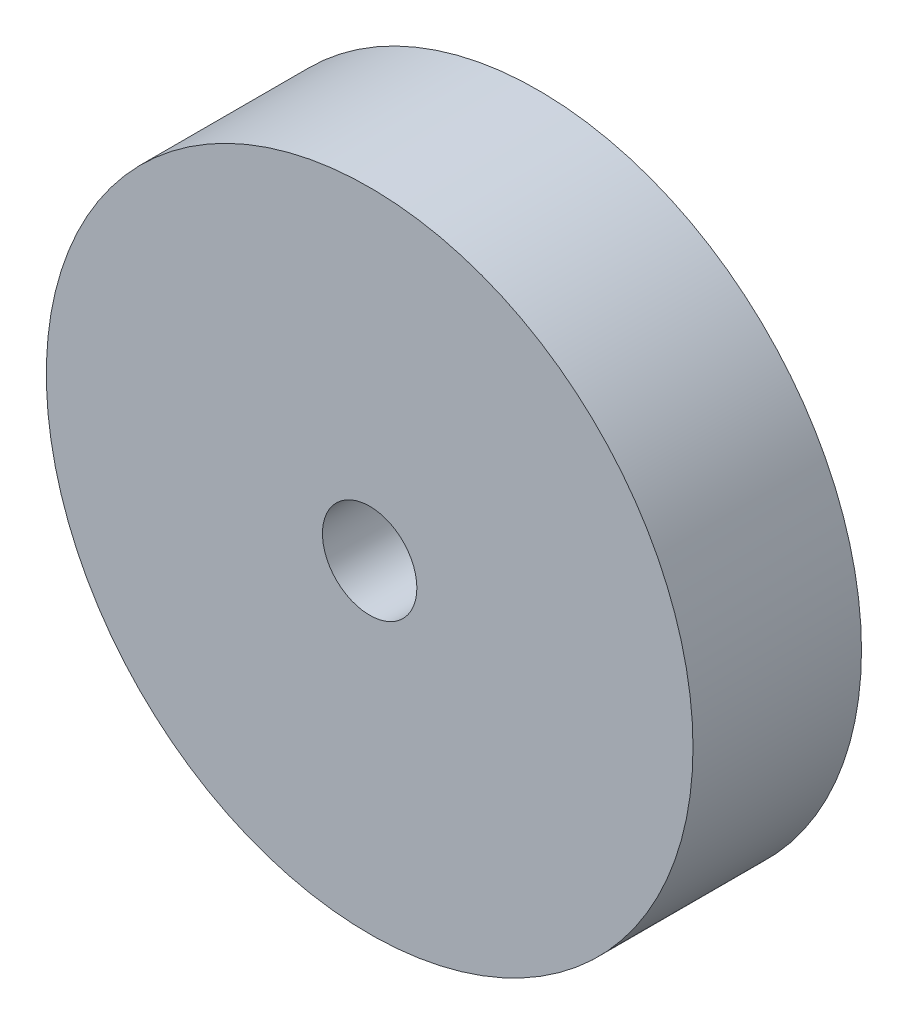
from build123d import *

# Parameters (mm, degrees)
SKETCH1_W               = 18.2
SKETCH1_H               = 34.925
M12X1_75_TAPPED_HOLE1_D = 10.2


with BuildPart() as part:
    # Sketch1 → Base-Revolve (revolve)
    with BuildSketch(Plane(origin=(0, 0, 0), x_dir=(0, 0, -1), z_dir=(1, 0, 0)), mode=Mode.PRIVATE) as base_revolve_sk:
        with Locations((0, 17.4625)):
            Rectangle(SKETCH1_W, SKETCH1_H)
    revolve(base_revolve_sk.sketch.rotate(Axis((0, 0, 0), (0, 0, -1)), 90), axis=Axis((0, 0, 0), (0, 0, -1)))

    # M12x1.75 Tapped Hole1 (through all)
    with Locations(Plane.XY.offset(9.1)):
        with Locations((0, 0)):
            Hole(M12X1_75_TAPPED_HOLE1_D / 2)


solid = part.part
